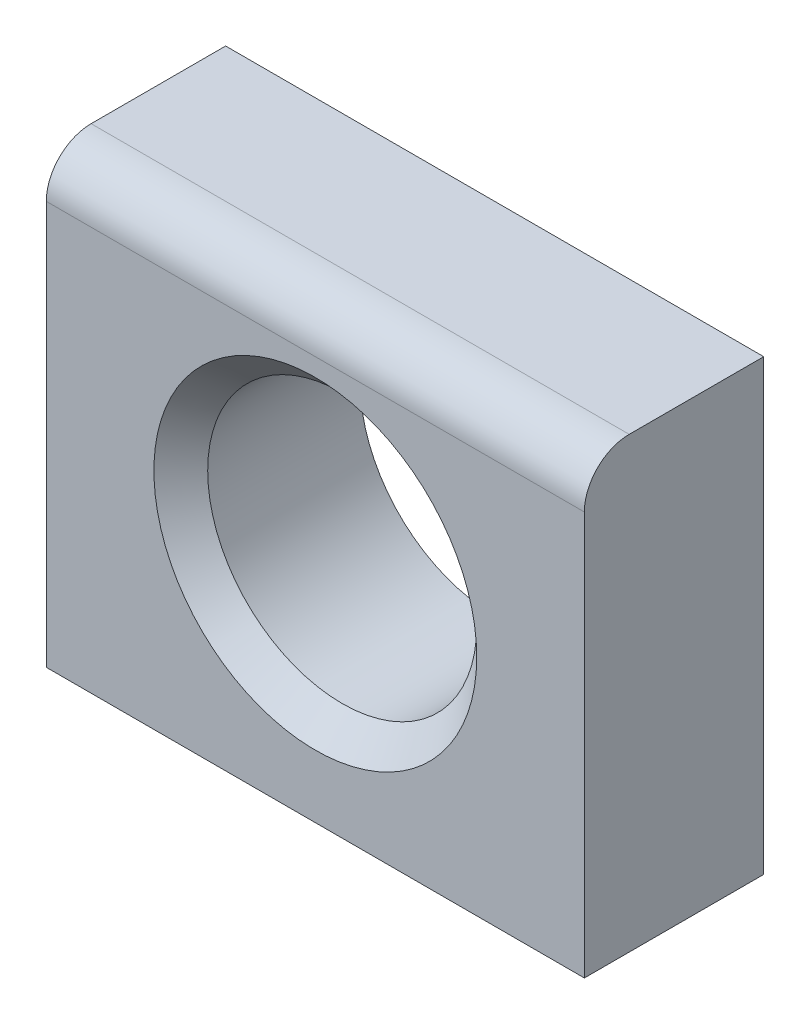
ISO-10303-21;
HEADER;
FILE_DESCRIPTION(('STEP AP214'),'2;1');
FILE_NAME('part.step','',(''),(''),'','','');
FILE_SCHEMA(('AUTOMOTIVE_DESIGN { 1 0 10303 214 1 1 1 1 }'));
ENDSEC;
DATA;
#1=APPLICATION_CONTEXT('core data for automotive mechanical design processes');
#2=APPLICATION_PROTOCOL_DEFINITION('international standard','automotive_design',2000,#1);
#3=PRODUCT_CONTEXT('',#1,'mechanical');
#4=PRODUCT('Part','Part','',(#3));
#5=PRODUCT_RELATED_PRODUCT_CATEGORY('part','',(#4));
#6=PRODUCT_DEFINITION_FORMATION('','',#4);
#7=PRODUCT_DEFINITION_CONTEXT('part definition',#1,'design');
#8=PRODUCT_DEFINITION('design','',#6,#7);
#9=PRODUCT_DEFINITION_SHAPE('','',#8);
#10=(LENGTH_UNIT() NAMED_UNIT(*) SI_UNIT(.MILLI.,.METRE.));
#11=(NAMED_UNIT(*) PLANE_ANGLE_UNIT() SI_UNIT($,.RADIAN.));
#12=(NAMED_UNIT(*) SI_UNIT($,.STERADIAN.) SOLID_ANGLE_UNIT());
#13=UNCERTAINTY_MEASURE_WITH_UNIT(LENGTH_MEASURE(1.E-05),#10,'distance_accuracy_value','');
#14=(GEOMETRIC_REPRESENTATION_CONTEXT(3) GLOBAL_UNCERTAINTY_ASSIGNED_CONTEXT((#13)) GLOBAL_UNIT_ASSIGNED_CONTEXT((#10,
#11,#12)) REPRESENTATION_CONTEXT('',''));
#15=CARTESIAN_POINT('',(0.,0.,0.));
#16=DIRECTION('',(0.,0.,1.));
#17=DIRECTION('',(1.,0.,0.));
#18=AXIS2_PLACEMENT_3D('',#15,#16,#17);
#19=CARTESIAN_POINT('',(-30.,-25.,20.));
#20=DIRECTION('',(1.,0.,0.));
#21=DIRECTION('',(0.,0.,-1.));
#22=AXIS2_PLACEMENT_3D('',#19,#20,#21);
#23=PLANE('',#22);
#24=DIRECTION('',(0.,-1.,0.));
#25=VECTOR('',#24,1.);
#26=CARTESIAN_POINT('',(-30.,-25.,20.));
#27=LINE('',#26,#25);
#28=CARTESIAN_POINT('',(-30.,20.,20.));
#29=VERTEX_POINT('',#28);
#30=CARTESIAN_POINT('',(-30.,-25.,20.));
#31=VERTEX_POINT('',#30);
#32=EDGE_CURVE('E76',#29,#31,#27,.T.);
#33=ORIENTED_EDGE('',*,*,#32,.F.);
#34=CARTESIAN_POINT('',(-30.,20.,15.));
#35=DIRECTION('',(1.,0.,0.));
#36=DIRECTION('',(0.,0.,-1.));
#37=AXIS2_PLACEMENT_3D('',#34,#35,#36);
#38=CIRCLE('',#37,5.);
#39=CARTESIAN_POINT('',(-30.,25.,15.));
#40=VERTEX_POINT('',#39);
#41=EDGE_CURVE('E54',#29,#40,#38,.F.);
#42=ORIENTED_EDGE('',*,*,#41,.T.);
#43=DIRECTION('',(0.,0.,-1.));
#44=VECTOR('',#43,1.);
#45=CARTESIAN_POINT('',(-30.,25.,20.));
#46=LINE('',#45,#44);
#47=CARTESIAN_POINT('',(-30.,25.,0.));
#48=VERTEX_POINT('',#47);
#49=EDGE_CURVE('E132',#40,#48,#46,.T.);
#50=ORIENTED_EDGE('',*,*,#49,.T.);
#51=DIRECTION('',(0.,-1.,0.));
#52=VECTOR('',#51,1.);
#53=CARTESIAN_POINT('',(-30.,-25.,0.));
#54=LINE('',#53,#52);
#55=CARTESIAN_POINT('',(-30.,-25.,0.));
#56=VERTEX_POINT('',#55);
#57=EDGE_CURVE('E98',#48,#56,#54,.T.);
#58=ORIENTED_EDGE('',*,*,#57,.T.);
#59=DIRECTION('',(0.,0.,-1.));
#60=VECTOR('',#59,1.);
#61=CARTESIAN_POINT('',(-30.,-25.,20.));
#62=LINE('',#61,#60);
#63=EDGE_CURVE('E90',#31,#56,#62,.T.);
#64=ORIENTED_EDGE('',*,*,#63,.F.);
#65=EDGE_LOOP('',(#33,#42,#50,#58,#64));
#66=FACE_BOUND('',#65,.T.);
#67=ADVANCED_FACE('F32',(#66),#23,.F.);
#68=CARTESIAN_POINT('',(30.,-25.,20.));
#69=DIRECTION('',(0.,1.,0.));
#70=DIRECTION('',(-1.,0.,0.));
#71=AXIS2_PLACEMENT_3D('',#68,#69,#70);
#72=PLANE('',#71);
#73=DIRECTION('',(1.,0.,0.));
#74=VECTOR('',#73,1.);
#75=CARTESIAN_POINT('',(30.,-25.,0.));
#76=LINE('',#75,#74);
#77=CARTESIAN_POINT('',(30.,-25.,0.));
#78=VERTEX_POINT('',#77);
#79=EDGE_CURVE('E129',#56,#78,#76,.T.);
#80=ORIENTED_EDGE('',*,*,#79,.T.);
#81=DIRECTION('',(0.,0.,-1.));
#82=VECTOR('',#81,1.);
#83=CARTESIAN_POINT('',(30.,-25.,20.));
#84=LINE('',#83,#82);
#85=CARTESIAN_POINT('',(30.,-25.,20.));
#86=VERTEX_POINT('',#85);
#87=EDGE_CURVE('E93',#86,#78,#84,.T.);
#88=ORIENTED_EDGE('',*,*,#87,.F.);
#89=DIRECTION('',(1.,0.,0.));
#90=VECTOR('',#89,1.);
#91=CARTESIAN_POINT('',(30.,-25.,20.));
#92=LINE('',#91,#90);
#93=EDGE_CURVE('E80',#31,#86,#92,.T.);
#94=ORIENTED_EDGE('',*,*,#93,.F.);
#95=ORIENTED_EDGE('',*,*,#63,.T.);
#96=EDGE_LOOP('',(#80,#88,#94,#95));
#97=FACE_BOUND('',#96,.T.);
#98=ADVANCED_FACE('F89',(#97),#72,.F.);
#99=CARTESIAN_POINT('',(30.,-25.,20.));
#100=DIRECTION('',(-1.,0.,0.));
#101=DIRECTION('',(0.,0.,1.));
#102=AXIS2_PLACEMENT_3D('',#99,#100,#101);
#103=PLANE('',#102);
#104=DIRECTION('',(0.,0.,-1.));
#105=VECTOR('',#104,1.);
#106=CARTESIAN_POINT('',(30.,25.,20.));
#107=LINE('',#106,#105);
#108=CARTESIAN_POINT('',(30.,25.,15.));
#109=VERTEX_POINT('',#108);
#110=CARTESIAN_POINT('',(30.,25.,0.));
#111=VERTEX_POINT('',#110);
#112=EDGE_CURVE('E104',#109,#111,#107,.T.);
#113=ORIENTED_EDGE('',*,*,#112,.F.);
#114=CARTESIAN_POINT('',(30.,20.,15.));
#115=DIRECTION('',(-1.,0.,0.));
#116=DIRECTION('',(0.,0.,1.));
#117=AXIS2_PLACEMENT_3D('',#114,#115,#116);
#118=CIRCLE('',#117,5.);
#119=CARTESIAN_POINT('',(30.,20.,20.));
#120=VERTEX_POINT('',#119);
#121=EDGE_CURVE('E11',#109,#120,#118,.F.);
#122=ORIENTED_EDGE('',*,*,#121,.T.);
#123=DIRECTION('',(0.,1.,0.));
#124=VECTOR('',#123,1.);
#125=CARTESIAN_POINT('',(30.,-25.,20.));
#126=LINE('',#125,#124);
#127=EDGE_CURVE('E95',#86,#120,#126,.T.);
#128=ORIENTED_EDGE('',*,*,#127,.F.);
#129=ORIENTED_EDGE('',*,*,#87,.T.);
#130=DIRECTION('',(0.,1.,0.));
#131=VECTOR('',#130,1.);
#132=CARTESIAN_POINT('',(30.,-25.,0.));
#133=LINE('',#132,#131);
#134=EDGE_CURVE('E135',#78,#111,#133,.T.);
#135=ORIENTED_EDGE('',*,*,#134,.T.);
#136=EDGE_LOOP('',(#113,#122,#128,#129,#135));
#137=FACE_BOUND('',#136,.T.);
#138=ADVANCED_FACE('F145',(#137),#103,.F.);
#139=CARTESIAN_POINT('',(30.,25.,20.));
#140=DIRECTION('',(0.,-1.,0.));
#141=DIRECTION('',(1.,0.,0.));
#142=AXIS2_PLACEMENT_3D('',#139,#140,#141);
#143=PLANE('',#142);
#144=ORIENTED_EDGE('',*,*,#49,.F.);
#145=DIRECTION('',(-1.,0.,0.));
#146=VECTOR('',#145,1.);
#147=CARTESIAN_POINT('',(30.,25.,15.));
#148=LINE('',#147,#146);
#149=EDGE_CURVE('E40',#40,#109,#148,.F.);
#150=ORIENTED_EDGE('',*,*,#149,.T.);
#151=ORIENTED_EDGE('',*,*,#112,.T.);
#152=DIRECTION('',(-1.,0.,0.));
#153=VECTOR('',#152,1.);
#154=CARTESIAN_POINT('',(30.,25.,0.));
#155=LINE('',#154,#153);
#156=EDGE_CURVE('E85',#111,#48,#155,.T.);
#157=ORIENTED_EDGE('',*,*,#156,.T.);
#158=EDGE_LOOP('',(#144,#150,#151,#157));
#159=FACE_BOUND('',#158,.T.);
#160=ADVANCED_FACE('F140',(#159),#143,.F.);
#161=CARTESIAN_POINT('',(0.,0.,20.));
#162=DIRECTION('',(0.,0.,1.));
#163=DIRECTION('',(1.,0.,0.));
#164=AXIS2_PLACEMENT_3D('',#161,#162,#163);
#165=PLANE('',#164);
#166=CARTESIAN_POINT('',(0.,0.,20.));
#167=DIRECTION('',(0.,0.,1.));
#168=DIRECTION('',(1.,0.,0.));
#169=AXIS2_PLACEMENT_3D('',#166,#167,#168);
#170=CIRCLE('',#169,18.);
#171=CARTESIAN_POINT('',(18.,0.,20.));
#172=VERTEX_POINT('',#171);
#173=EDGE_CURVE('E102',#172,#172,#170,.F.);
#174=ORIENTED_EDGE('',*,*,#173,.T.);
#175=EDGE_LOOP('',(#174));
#176=FACE_BOUND('',#175,.T.);
#177=ORIENTED_EDGE('',*,*,#127,.T.);
#178=DIRECTION('',(-1.,0.,0.));
#179=VECTOR('',#178,1.);
#180=CARTESIAN_POINT('',(-30.,20.,20.));
#181=LINE('',#180,#179);
#182=EDGE_CURVE('E83',#120,#29,#181,.T.);
#183=ORIENTED_EDGE('',*,*,#182,.T.);
#184=ORIENTED_EDGE('',*,*,#32,.T.);
#185=ORIENTED_EDGE('',*,*,#93,.T.);
#186=EDGE_LOOP('',(#177,#183,#184,#185));
#187=FACE_BOUND('',#186,.T.);
#188=ADVANCED_FACE('F79',(#176,#187),#165,.T.);
#189=CARTESIAN_POINT('',(0.,0.,0.));
#190=DIRECTION('',(0.,0.,1.));
#191=DIRECTION('',(1.,0.,0.));
#192=AXIS2_PLACEMENT_3D('',#189,#190,#191);
#193=PLANE('',#192);
#194=CARTESIAN_POINT('',(0.,0.,0.));
#195=DIRECTION('',(0.,0.,1.));
#196=DIRECTION('',(1.,0.,0.));
#197=AXIS2_PLACEMENT_3D('',#194,#195,#196);
#198=CIRCLE('',#197,15.);
#199=CARTESIAN_POINT('',(15.,0.,0.));
#200=VERTEX_POINT('',#199);
#201=EDGE_CURVE('E126',#200,#200,#198,.T.);
#202=ORIENTED_EDGE('',*,*,#201,.T.);
#203=EDGE_LOOP('',(#202));
#204=FACE_BOUND('',#203,.T.);
#205=ORIENTED_EDGE('',*,*,#57,.F.);
#206=ORIENTED_EDGE('',*,*,#156,.F.);
#207=ORIENTED_EDGE('',*,*,#134,.F.);
#208=ORIENTED_EDGE('',*,*,#79,.F.);
#209=EDGE_LOOP('',(#205,#206,#207,#208));
#210=FACE_BOUND('',#209,.T.);
#211=ADVANCED_FACE('F122',(#204,#210),#193,.F.);
#212=CARTESIAN_POINT('',(0.,0.,0.));
#213=DIRECTION('',(0.,0.,1.));
#214=DIRECTION('',(1.,0.,0.));
#215=AXIS2_PLACEMENT_3D('',#212,#213,#214);
#216=CYLINDRICAL_SURFACE('',#215,15.);
#217=CARTESIAN_POINT('',(0.,0.,17.));
#218=DIRECTION('',(0.,0.,1.));
#219=DIRECTION('',(1.,0.,0.));
#220=AXIS2_PLACEMENT_3D('',#217,#218,#219);
#221=CIRCLE('',#220,15.);
#222=CARTESIAN_POINT('',(15.,0.,17.));
#223=VERTEX_POINT('',#222);
#224=EDGE_CURVE('E99',#223,#223,#221,.T.);
#225=ORIENTED_EDGE('',*,*,#224,.T.);
#226=EDGE_LOOP('',(#225));
#227=FACE_BOUND('',#226,.T.);
#228=ORIENTED_EDGE('',*,*,#201,.F.);
#229=EDGE_LOOP('',(#228));
#230=FACE_BOUND('',#229,.T.);
#231=ADVANCED_FACE('F117',(#227,#230),#216,.F.);
#232=CARTESIAN_POINT('',(0.,0.,17.));
#233=DIRECTION('',(0.,0.,1.));
#234=DIRECTION('',(1.,0.,0.));
#235=AXIS2_PLACEMENT_3D('',#232,#233,#234);
#236=CONICAL_SURFACE('',#235,15.,0.785398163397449);
#237=CARTESIAN_POINT('',(18.,0.,20.));
#238=CARTESIAN_POINT('',(17.96875,0.,19.96875));
#239=CARTESIAN_POINT('',(17.9375,0.,19.9375));
#240=CARTESIAN_POINT('',(17.875,0.,19.875));
#241=CARTESIAN_POINT('',(17.84375,0.,19.84375));
#242=CARTESIAN_POINT('',(17.78125,0.,19.78125));
#243=CARTESIAN_POINT('',(17.75,0.,19.75));
#244=CARTESIAN_POINT('',(17.6875,0.,19.6875));
#245=CARTESIAN_POINT('',(17.65625,0.,19.65625));
#246=CARTESIAN_POINT('',(17.59375,0.,19.59375));
#247=CARTESIAN_POINT('',(17.5625,0.,19.5625));
#248=CARTESIAN_POINT('',(17.5,0.,19.5));
#249=CARTESIAN_POINT('',(17.46875,0.,19.46875));
#250=CARTESIAN_POINT('',(17.40625,0.,19.40625));
#251=CARTESIAN_POINT('',(17.375,0.,19.375));
#252=CARTESIAN_POINT('',(17.3125,0.,19.3125));
#253=CARTESIAN_POINT('',(17.28125,0.,19.28125));
#254=CARTESIAN_POINT('',(17.21875,0.,19.21875));
#255=CARTESIAN_POINT('',(17.1875,0.,19.1875));
#256=CARTESIAN_POINT('',(17.125,0.,19.125));
#257=CARTESIAN_POINT('',(17.09375,0.,19.09375));
#258=CARTESIAN_POINT('',(17.03125,0.,19.03125));
#259=CARTESIAN_POINT('',(17.,0.,19.));
#260=CARTESIAN_POINT('',(16.9375,0.,18.9375));
#261=CARTESIAN_POINT('',(16.90625,0.,18.90625));
#262=CARTESIAN_POINT('',(16.84375,0.,18.84375));
#263=CARTESIAN_POINT('',(16.8125,0.,18.8125));
#264=CARTESIAN_POINT('',(16.75,0.,18.75));
#265=CARTESIAN_POINT('',(16.71875,0.,18.71875));
#266=CARTESIAN_POINT('',(16.65625,0.,18.65625));
#267=CARTESIAN_POINT('',(16.625,0.,18.625));
#268=CARTESIAN_POINT('',(16.5625,0.,18.5625));
#269=CARTESIAN_POINT('',(16.53125,0.,18.53125));
#270=CARTESIAN_POINT('',(16.46875,0.,18.46875));
#271=CARTESIAN_POINT('',(16.4375,0.,18.4375));
#272=CARTESIAN_POINT('',(16.375,0.,18.375));
#273=CARTESIAN_POINT('',(16.34375,0.,18.34375));
#274=CARTESIAN_POINT('',(16.28125,0.,18.28125));
#275=CARTESIAN_POINT('',(16.25,0.,18.25));
#276=CARTESIAN_POINT('',(16.1875,0.,18.1875));
#277=CARTESIAN_POINT('',(16.15625,0.,18.15625));
#278=CARTESIAN_POINT('',(16.09375,0.,18.09375));
#279=CARTESIAN_POINT('',(16.0625,0.,18.0625));
#280=CARTESIAN_POINT('',(16.,0.,18.));
#281=CARTESIAN_POINT('',(15.96875,0.,17.96875));
#282=CARTESIAN_POINT('',(15.90625,0.,17.90625));
#283=CARTESIAN_POINT('',(15.875,0.,17.875));
#284=CARTESIAN_POINT('',(15.8125,0.,17.8125));
#285=CARTESIAN_POINT('',(15.78125,0.,17.78125));
#286=CARTESIAN_POINT('',(15.71875,0.,17.71875));
#287=CARTESIAN_POINT('',(15.6875,0.,17.6875));
#288=CARTESIAN_POINT('',(15.625,0.,17.625));
#289=CARTESIAN_POINT('',(15.59375,0.,17.59375));
#290=CARTESIAN_POINT('',(15.53125,0.,17.53125));
#291=CARTESIAN_POINT('',(15.5,0.,17.5));
#292=CARTESIAN_POINT('',(15.4375,0.,17.4375));
#293=CARTESIAN_POINT('',(15.40625,0.,17.40625));
#294=CARTESIAN_POINT('',(15.34375,0.,17.34375));
#295=CARTESIAN_POINT('',(15.3125,0.,17.3125));
#296=CARTESIAN_POINT('',(15.25,0.,17.25));
#297=CARTESIAN_POINT('',(15.21875,0.,17.21875));
#298=CARTESIAN_POINT('',(15.15625,0.,17.15625));
#299=CARTESIAN_POINT('',(15.125,0.,17.125));
#300=CARTESIAN_POINT('',(15.0625,0.,17.0625));
#301=CARTESIAN_POINT('',(15.03125,0.,17.03125));
#302=CARTESIAN_POINT('',(15.,0.,17.));
#303=B_SPLINE_CURVE_WITH_KNOTS('',3,(#237,#238,#239,#240,#241,#242,#243,#244,#245,#246,#247,
#248,#249,#250,#251,#252,#253,#254,#255,#256,#257,#258,#259,#260,#261,#262,#263,#264,#265,#266,
#267,#268,#269,#270,#271,#272,#273,#274,#275,#276,#277,#278,#279,#280,#281,#282,#283,#284,#285,
#286,#287,#288,#289,#290,#291,#292,#293,#294,#295,#296,#297,#298,#299,#300,#301,#302),
.UNSPECIFIED.,.F.,.F.,(4,2,2,2,2,2,2,2,2,2,2,2,2,2,2,2,2,2,2,2,2,2,2,2,2,2,2,2,2,2,2,2,4),(0.,
0.132582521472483,0.26516504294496,0.397747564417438,0.530330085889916,0.662912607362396,
0.795495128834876,0.928077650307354,1.06066017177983,1.19324269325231,1.32582521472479,
1.45840773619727,1.59099025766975,1.72357277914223,1.85615530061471,1.98873782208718,
2.12132034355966,2.25390286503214,2.38648538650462,2.5190679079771,2.65165042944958,
2.78423295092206,2.91681547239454,3.04939799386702,3.1819805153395,3.31456303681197,
3.44714555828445,3.57972807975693,3.71231060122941,3.84489312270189,3.97747564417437,
4.11005816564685,4.24264068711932),.UNSPECIFIED.);
#304=EDGE_CURVE('BSEAM114',#172,#223,#303,.T.);
#305=ORIENTED_EDGE('',*,*,#173,.F.);
#306=ORIENTED_EDGE('',*,*,#224,.F.);
#307=ORIENTED_EDGE('',*,*,#304,.T.);
#308=ORIENTED_EDGE('',*,*,#304,.F.);
#309=EDGE_LOOP('',(#305,#307,#306,#308));
#310=FACE_BOUND('',#309,.T.);
#311=ADVANCED_FACE('F114',(#310),#236,.F.);
#312=CARTESIAN_POINT('',(0.,20.,15.));
#313=DIRECTION('',(1.,0.,0.));
#314=DIRECTION('',(0.,1.,0.));
#315=AXIS2_PLACEMENT_3D('',#312,#313,#314);
#316=CYLINDRICAL_SURFACE('',#315,5.);
#317=ORIENTED_EDGE('',*,*,#121,.F.);
#318=ORIENTED_EDGE('',*,*,#149,.F.);
#319=ORIENTED_EDGE('',*,*,#41,.F.);
#320=ORIENTED_EDGE('',*,*,#182,.F.);
#321=EDGE_LOOP('',(#317,#318,#319,#320));
#322=FACE_BOUND('',#321,.T.);
#323=ADVANCED_FACE('F34',(#322),#316,.T.);
#324=CLOSED_SHELL('',(#67,#98,#138,#160,#188,#211,#231,#311,#323));
#325=MANIFOLD_SOLID_BREP('B2',#324);
#326=ADVANCED_BREP_SHAPE_REPRESENTATION('',(#18,#325),#14);
#327=SHAPE_DEFINITION_REPRESENTATION(#9,#326);
ENDSEC;
END-ISO-10303-21;
